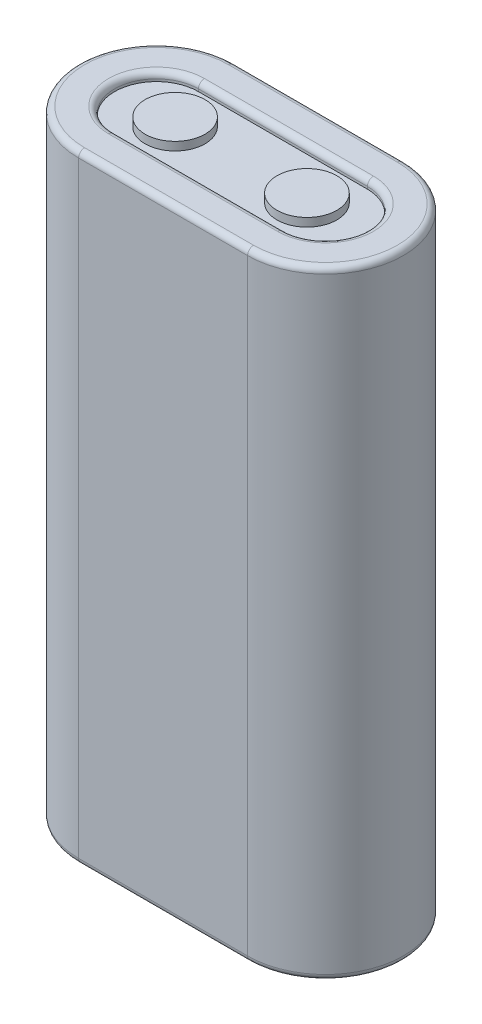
from build123d import *

# Parameters (mm, degrees)
BASE_EXTRUDE_DEPTH = 51.6
SKETCH2_OUTSIDE_W  = 26.532
SKETCH2_OUTSIDE_H  = 25.982
SKETCH2_OUTSIDE_R  = 2.5
CUT_EXTRUDE1_DEPTH = 0.7
FILLET1_R          = 0.5


with BuildPart() as part:
    # Sketch1 → Base-Extrude (new body)
    with BuildSketch(Plane(origin=(0, 0, 0), x_dir=(1, 0, 0), z_dir=(0, 1, 0))):
        with BuildLine():
            Line((7.05, -6.5), (0, -6.5))
            Line((0, -6.5), (0, 6.5))
            Line((0, 6.5), (7.05, 6.5))
            ThreePointArc((7.05, 6.5), (13.55, 0), (7.05, -6.5))
        make_face()
    extrude(amount=BASE_EXTRUDE_DEPTH)

    # Sketch2 outside → Cut-Extrude1 (cut)
    with BuildSketch(Plane(origin=(0, 51.6, 0), x_dir=(-1, 0, 0), z_dir=(0, 1, 0))):
        with Locations((-6.775, 0)):
            Rectangle(SKETCH2_OUTSIDE_W, SKETCH2_OUTSIDE_H)
        with Locations(Location((-5.5, 0, 0), (0, 0, 90))):
            Circle(SKETCH2_OUTSIDE_R, mode=Mode.SUBTRACT)
        with BuildLine():
            Line((0, -3.5), (0, -6.5))
            Line((0, -6.5), (-7.05, -6.5))
            ThreePointArc((-7.05, -6.5), (-13.55, 0), (-7.05, 6.5))
            Line((-7.05, 6.5), (0, 6.5))
            Line((0, 6.5), (0, 3.5))
            Line((0, 3.5), (-7.05, 3.5))
            ThreePointArc((-7.05, 3.5), (-10.55, 0), (-7.05, -3.5))
            Line((-7.05, -3.5), (0, -3.5))
        make_face(mode=Mode.SUBTRACT)
    extrude(amount=-CUT_EXTRUDE1_DEPTH, mode=Mode.SUBTRACT)

    # Mirror All1: part across plane


with BuildPart() as part_1:
    add(part.part)
    add(part.part.mirror(Plane(origin=(0, 51.6, 6.5), x_dir=(0, 0, 1), z_dir=(1, 0, 0))))

    # Fillet1
    fillet1_edges = [part_1.edges().sort_by_distance(p)[0] for p in [
        (13.55, 51.6, 0),
        (0, 51.6, -6.5),
        (0, 51.6, 3.5),
        (10.55, 51.6, 0),
        (0, 51.6, -3.5),
        (0, 0, -6.5),
        (13.55, 0, 0),
        (0, 0, 6.5),
        (-13.55, 51.6, 0),
        (-13.55, 0, 0),
        (-10.55, 51.6, 0),
        (0, 51.6, 6.5),
    ]]
    fillet(fillet1_edges, radius=FILLET1_R)


solid = part_1.part
